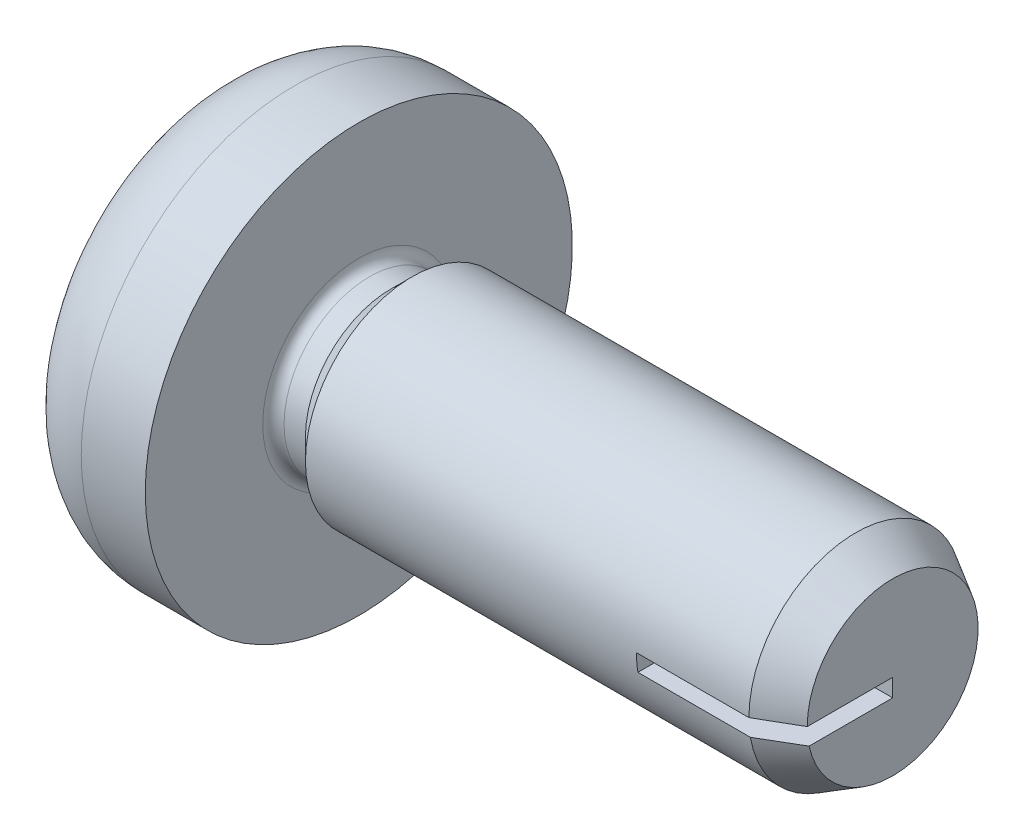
from build123d import *

# Parameters (mm, degrees)
CUT_EXTRUDE3_DEPTH         = 4
DRAFT1_ANGLE               = 20
RECESSI_CUT_EXTRUDE5_DEPTH = 4
SKETCH11_W                 = 5.6
SKETCH11_H                 = 0.666666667
POINT_CUT_EXTRUDE8_DEPTH   = 28.988569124


with BuildPart() as part:
    # Sketch1 → base-Revolve (revolve)
    with BuildSketch(Plane.XY, mode=Mode.PRIVATE) as base_revolve_sk:
        with BuildLine():
            Line((0, 0), (0, 4.8))
            ThreePointArc((0, 4.8), (0.9372583, 7.0627417), (3.2, 8))
            Line((3.2, 8), (5.6, 8))
            Line((5.6, 8), (5.6, 3.6))
            ThreePointArc((5.6, 3.6), (5.717157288, 3.317157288), (6, 3.2))
            Line((6, 3.2), (6.8, 3.2))
            Line((6.8, 3.2), (7.6, 4))
            Line((7.6, 4), (25.6, 4))
            Line((25.6, 4), (25.6, 0))
            Line((25.6, 0), (0, 0))
        make_face()
    revolve(base_revolve_sk.sketch.rotate(Axis((0, 0, 0), (1, 0, 0)), 90), axis=Axis((0, 0, 0), (1, 0, 0)))

    # Sketch4 → Cut-Extrude3 (cut)
    with BuildSketch(Plane(origin=(0, 0, 0), x_dir=(0, 0, -1), z_dir=(1, 0, 0))):
        Polygon((0.9, 4.39), (-0.9, 4.39), (-0.9, 0.9), (-4.39, 0.9), (-4.39, -0.9), (-0.9, -0.9), (-0.9, -4.39), (0.9, -4.39), (0.9, -0.9), (4.39, -0.9), (4.39, 0.9), (0.9, 0.9), align=None)
    extrude(amount=CUT_EXTRUDE3_DEPTH, mode=Mode.SUBTRACT)

    # Draft1
    draft1_faces = [part.faces().sort_by_distance(p)[0] for p in [
        (2, 0, -4.39),
        (2, -4.39, 0),
        (2, 0, 4.39),
        (2, 4.39, 0),
    ]]
    draft(draft1_faces, Plane(origin=(0, 0, 0), x_dir=(0, 0, -1), z_dir=(-1, 0, 0)), DRAFT1_ANGLE)

    # Sketch5 → recessI_Cut-Extrude5 (cut)
    with BuildSketch(Plane.ZY):
        Polygon((0.9, 1.778), (1.778, 0.9), (0.9, 0.9), align=None)
        Polygon((-0.9, 0.9), (-1.778, 0.9), (-0.9, 1.778), align=None)
        Polygon((-0.9, -1.778), (-1.778, -0.9), (-0.9, -0.9), align=None)
        Polygon((0.9, -0.9), (1.778, -0.9), (0.9, -1.778), align=None)
    extrude(amount=-RECESSI_CUT_EXTRUDE5_DEPTH, mode=Mode.SUBTRACT)

    # Sketch8 → point_Cut-Revolve1 (revolve, cut)
    with BuildSketch(Plane.XY, mode=Mode.PRIVATE) as point_cut_revolve1_sk:
        Polygon((25.6, 0), (26.108, 0), (26.108, 4.508), (24.214359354, 4.508), (24.214359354, 4), (25.6, 3.2), align=None)
    revolve(point_cut_revolve1_sk.sketch.rotate(Axis((0, 0, 0), (1, 0, 0)), 90), axis=Axis((0, 0, 0), (1, 0, 0)), mode=Mode.SUBTRACT)

    # Sketch11 → point_Cut-Extrude8 (cut, through all)
    with BuildSketch(Plane.XY):
        with Locations((22.8, -0.333333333)):
            Rectangle(SKETCH11_W, SKETCH11_H)
    extrude(amount=POINT_CUT_EXTRUDE8_DEPTH, mode=Mode.SUBTRACT)


solid = part.part
